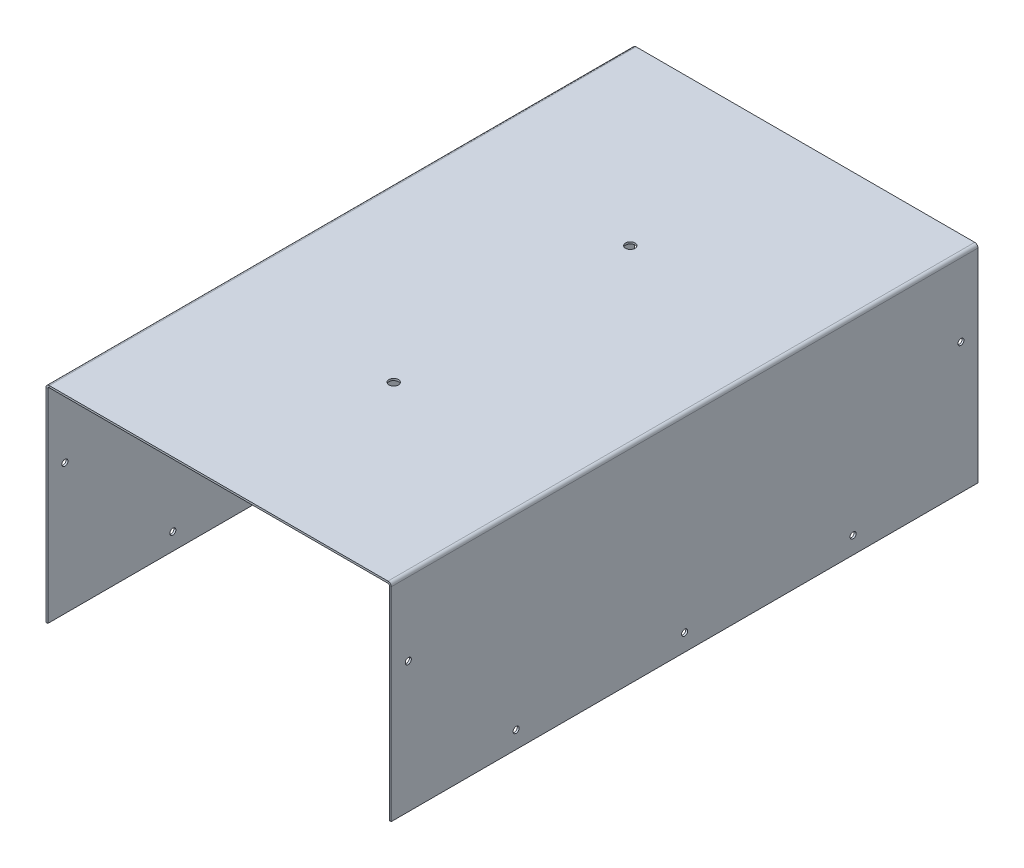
ISO-10303-21;
HEADER;
FILE_DESCRIPTION(('STEP AP214'),'2;1');
FILE_NAME('part.step','',(''),(''),'','','');
FILE_SCHEMA(('AUTOMOTIVE_DESIGN { 1 0 10303 214 1 1 1 1 }'));
ENDSEC;
DATA;
#1=APPLICATION_CONTEXT('core data for automotive mechanical design processes');
#2=APPLICATION_PROTOCOL_DEFINITION('international standard','automotive_design',2000,#1);
#3=PRODUCT_CONTEXT('',#1,'mechanical');
#4=PRODUCT('Part','Part','',(#3));
#5=PRODUCT_RELATED_PRODUCT_CATEGORY('part','',(#4));
#6=PRODUCT_DEFINITION_FORMATION('','',#4);
#7=PRODUCT_DEFINITION_CONTEXT('part definition',#1,'design');
#8=PRODUCT_DEFINITION('design','',#6,#7);
#9=PRODUCT_DEFINITION_SHAPE('','',#8);
#10=(LENGTH_UNIT() NAMED_UNIT(*) SI_UNIT(.MILLI.,.METRE.));
#11=(NAMED_UNIT(*) PLANE_ANGLE_UNIT() SI_UNIT($,.RADIAN.));
#12=(NAMED_UNIT(*) SI_UNIT($,.STERADIAN.) SOLID_ANGLE_UNIT());
#13=UNCERTAINTY_MEASURE_WITH_UNIT(LENGTH_MEASURE(1.E-05),#10,'distance_accuracy_value','');
#14=(GEOMETRIC_REPRESENTATION_CONTEXT(3) GLOBAL_UNCERTAINTY_ASSIGNED_CONTEXT((#13)) GLOBAL_UNIT_ASSIGNED_CONTEXT((#10,
#11,#12)) REPRESENTATION_CONTEXT('',''));
#15=CARTESIAN_POINT('',(0.,0.,0.));
#16=DIRECTION('',(0.,0.,1.));
#17=DIRECTION('',(1.,0.,0.));
#18=AXIS2_PLACEMENT_3D('',#15,#16,#17);
#19=CARTESIAN_POINT('',(-90.2,-1.,-155.));
#20=DIRECTION('',(0.,1.,0.));
#21=DIRECTION('',(0.,0.,1.));
#22=AXIS2_PLACEMENT_3D('',#19,#20,#21);
#23=PLANE('',#22);
#24=CARTESIAN_POINT('',(1.30236736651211E-12,-1.,62.5));
#25=DIRECTION('',(0.,1.,0.));
#26=DIRECTION('',(0.,0.,1.));
#27=AXIS2_PLACEMENT_3D('',#24,#25,#26);
#28=CIRCLE('',#27,2.5);
#29=CARTESIAN_POINT('',(1.30236736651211E-12,-1.,65.));
#30=VERTEX_POINT('',#29);
#31=EDGE_CURVE('E303',#30,#30,#28,.F.);
#32=ORIENTED_EDGE('',*,*,#31,.F.);
#33=EDGE_LOOP('',(#32));
#34=FACE_BOUND('',#33,.T.);
#35=CARTESIAN_POINT('',(0.,-1.,-62.5));
#36=DIRECTION('',(0.,1.,0.));
#37=DIRECTION('',(0.,0.,1.));
#38=AXIS2_PLACEMENT_3D('',#35,#36,#37);
#39=CIRCLE('',#38,2.5);
#40=CARTESIAN_POINT('',(0.,-1.,-60.));
#41=VERTEX_POINT('',#40);
#42=EDGE_CURVE('E309',#41,#41,#39,.F.);
#43=ORIENTED_EDGE('',*,*,#42,.F.);
#44=EDGE_LOOP('',(#43));
#45=FACE_BOUND('',#44,.T.);
#46=DIRECTION('',(0.,0.,-1.));
#47=VECTOR('',#46,1.);
#48=CARTESIAN_POINT('',(-89.4634,-1.00000000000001,-155.));
#49=LINE('',#48,#47);
#50=CARTESIAN_POINT('',(-89.4634,-1.00000000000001,-155.));
#51=VERTEX_POINT('',#50);
#52=CARTESIAN_POINT('',(-89.4634,-1.00000000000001,155.));
#53=VERTEX_POINT('',#52);
#54=EDGE_CURVE('E182',#51,#53,#49,.F.);
#55=ORIENTED_EDGE('',*,*,#54,.F.);
#56=DIRECTION('',(-1.,0.,0.));
#57=VECTOR('',#56,1.);
#58=CARTESIAN_POINT('',(90.2,-1.,-155.));
#59=LINE('',#58,#57);
#60=CARTESIAN_POINT('',(89.4634,-0.999999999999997,-155.));
#61=VERTEX_POINT('',#60);
#62=EDGE_CURVE('E11',#61,#51,#59,.T.);
#63=ORIENTED_EDGE('',*,*,#62,.F.);
#64=DIRECTION('',(0.,0.,1.));
#65=VECTOR('',#64,1.);
#66=CARTESIAN_POINT('',(89.4634,-0.999999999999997,155.));
#67=LINE('',#66,#65);
#68=CARTESIAN_POINT('',(89.4634,-0.999999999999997,155.));
#69=VERTEX_POINT('',#68);
#70=EDGE_CURVE('E230',#69,#61,#67,.F.);
#71=ORIENTED_EDGE('',*,*,#70,.F.);
#72=DIRECTION('',(1.,0.,0.));
#73=VECTOR('',#72,1.);
#74=CARTESIAN_POINT('',(90.2,-1.,155.));
#75=LINE('',#74,#73);
#76=EDGE_CURVE('E46',#53,#69,#75,.T.);
#77=ORIENTED_EDGE('',*,*,#76,.F.);
#78=EDGE_LOOP('',(#55,#63,#71,#77));
#79=FACE_BOUND('',#78,.T.);
#80=ADVANCED_FACE('F37',(#34,#45,#79),#23,.F.);
#81=CARTESIAN_POINT('',(-90.2,0.,-155.));
#82=DIRECTION('',(0.,1.,0.));
#83=DIRECTION('',(0.,0.,1.));
#84=AXIS2_PLACEMENT_3D('',#81,#82,#83);
#85=PLANE('',#84);
#86=CARTESIAN_POINT('',(1.30236736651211E-12,0.,62.5));
#87=DIRECTION('',(0.,1.,0.));
#88=DIRECTION('',(0.,0.,1.));
#89=AXIS2_PLACEMENT_3D('',#86,#87,#88);
#90=CIRCLE('',#89,2.5);
#91=CARTESIAN_POINT('',(1.30236736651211E-12,0.,65.));
#92=VERTEX_POINT('',#91);
#93=EDGE_CURVE('E300',#92,#92,#90,.T.);
#94=ORIENTED_EDGE('',*,*,#93,.F.);
#95=EDGE_LOOP('',(#94));
#96=FACE_BOUND('',#95,.T.);
#97=CARTESIAN_POINT('',(0.,0.,-62.5));
#98=DIRECTION('',(0.,1.,0.));
#99=DIRECTION('',(0.,0.,1.));
#100=AXIS2_PLACEMENT_3D('',#97,#98,#99);
#101=CIRCLE('',#100,2.5);
#102=CARTESIAN_POINT('',(0.,0.,-60.));
#103=VERTEX_POINT('',#102);
#104=EDGE_CURVE('E306',#103,#103,#101,.T.);
#105=ORIENTED_EDGE('',*,*,#104,.F.);
#106=EDGE_LOOP('',(#105));
#107=FACE_BOUND('',#106,.T.);
#108=DIRECTION('',(-1.,0.,0.));
#109=VECTOR('',#108,1.);
#110=CARTESIAN_POINT('',(90.2,0.,-155.));
#111=LINE('',#110,#109);
#112=CARTESIAN_POINT('',(89.4634,0.,-155.));
#113=VERTEX_POINT('',#112);
#114=CARTESIAN_POINT('',(-89.4634,0.,-155.));
#115=VERTEX_POINT('',#114);
#116=EDGE_CURVE('E240',#113,#115,#111,.T.);
#117=ORIENTED_EDGE('',*,*,#116,.T.);
#118=DIRECTION('',(0.,0.,-1.));
#119=VECTOR('',#118,1.);
#120=CARTESIAN_POINT('',(-89.4634,0.,-155.));
#121=LINE('',#120,#119);
#122=CARTESIAN_POINT('',(-89.4634,0.,155.));
#123=VERTEX_POINT('',#122);
#124=EDGE_CURVE('E132',#115,#123,#121,.F.);
#125=ORIENTED_EDGE('',*,*,#124,.T.);
#126=DIRECTION('',(1.,0.,0.));
#127=VECTOR('',#126,1.);
#128=CARTESIAN_POINT('',(90.2,0.,155.));
#129=LINE('',#128,#127);
#130=CARTESIAN_POINT('',(89.4634,0.,155.));
#131=VERTEX_POINT('',#130);
#132=EDGE_CURVE('E236',#123,#131,#129,.T.);
#133=ORIENTED_EDGE('',*,*,#132,.T.);
#134=DIRECTION('',(0.,0.,1.));
#135=VECTOR('',#134,1.);
#136=CARTESIAN_POINT('',(89.4634,0.,155.));
#137=LINE('',#136,#135);
#138=EDGE_CURVE('E219',#131,#113,#137,.F.);
#139=ORIENTED_EDGE('',*,*,#138,.T.);
#140=EDGE_LOOP('',(#117,#125,#133,#139));
#141=FACE_BOUND('',#140,.T.);
#142=ADVANCED_FACE('F347',(#96,#107,#141),#85,.T.);
#143=CARTESIAN_POINT('',(90.2,-1.,-155.));
#144=DIRECTION('',(0.,0.,-1.));
#145=DIRECTION('',(-1.,0.,0.));
#146=AXIS2_PLACEMENT_3D('',#143,#144,#145);
#147=PLANE('',#146);
#148=ORIENTED_EDGE('',*,*,#62,.T.);
#149=DIRECTION('',(0.,1.,0.));
#150=VECTOR('',#149,1.);
#151=CARTESIAN_POINT('',(-89.4634,-1.00000000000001,-155.));
#152=LINE('',#151,#150);
#153=EDGE_CURVE('E178',#51,#115,#152,.T.);
#154=ORIENTED_EDGE('',*,*,#153,.T.);
#155=ORIENTED_EDGE('',*,*,#116,.F.);
#156=DIRECTION('',(0.,1.,0.));
#157=VECTOR('',#156,1.);
#158=CARTESIAN_POINT('',(89.4634,-0.999999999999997,-155.));
#159=LINE('',#158,#157);
#160=EDGE_CURVE('E234',#61,#113,#159,.T.);
#161=ORIENTED_EDGE('',*,*,#160,.F.);
#162=EDGE_LOOP('',(#148,#154,#155,#161));
#163=FACE_BOUND('',#162,.T.);
#164=ADVANCED_FACE('F353',(#163),#147,.T.);
#165=CARTESIAN_POINT('',(90.2,-1.,155.));
#166=DIRECTION('',(0.,0.,1.));
#167=DIRECTION('',(1.,0.,0.));
#168=AXIS2_PLACEMENT_3D('',#165,#166,#167);
#169=PLANE('',#168);
#170=DIRECTION('',(0.,1.,0.));
#171=VECTOR('',#170,1.);
#172=CARTESIAN_POINT('',(-89.4634,-1.00000000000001,155.));
#173=LINE('',#172,#171);
#174=EDGE_CURVE('E185',#53,#123,#173,.T.);
#175=ORIENTED_EDGE('',*,*,#174,.F.);
#176=ORIENTED_EDGE('',*,*,#76,.T.);
#177=DIRECTION('',(0.,1.,0.));
#178=VECTOR('',#177,1.);
#179=CARTESIAN_POINT('',(89.4634,-0.999999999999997,155.));
#180=LINE('',#179,#178);
#181=EDGE_CURVE('E224',#69,#131,#180,.T.);
#182=ORIENTED_EDGE('',*,*,#181,.T.);
#183=ORIENTED_EDGE('',*,*,#132,.F.);
#184=EDGE_LOOP('',(#175,#176,#182,#183));
#185=FACE_BOUND('',#184,.T.);
#186=ADVANCED_FACE('F39',(#185),#169,.T.);
#187=CARTESIAN_POINT('',(89.4634,-1.7366,-155.));
#188=DIRECTION('',(0.,0.,-1.));
#189=DIRECTION('',(-1.,0.,0.));
#190=AXIS2_PLACEMENT_3D('',#187,#188,#189);
#191=PLANE('',#190);
#192=DIRECTION('',(1.,0.,0.));
#193=VECTOR('',#192,1.);
#194=CARTESIAN_POINT('',(90.2,-1.7366,-155.));
#195=LINE('',#194,#193);
#196=CARTESIAN_POINT('',(90.2,-1.7366,-155.));
#197=VERTEX_POINT('',#196);
#198=CARTESIAN_POINT('',(91.2,-1.73659999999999,-155.));
#199=VERTEX_POINT('',#198);
#200=EDGE_CURVE('E187',#197,#199,#195,.T.);
#201=ORIENTED_EDGE('',*,*,#200,.F.);
#202=CARTESIAN_POINT('',(89.4634,-1.7366,-155.));
#203=DIRECTION('',(0.,0.,1.));
#204=DIRECTION('',(1.,0.,0.));
#205=AXIS2_PLACEMENT_3D('',#202,#203,#204);
#206=CIRCLE('',#205,0.736600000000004);
#207=EDGE_CURVE('E227',#61,#197,#206,.F.);
#208=ORIENTED_EDGE('',*,*,#207,.F.);
#209=ORIENTED_EDGE('',*,*,#160,.T.);
#210=CARTESIAN_POINT('',(89.4634,-1.7366,-155.));
#211=DIRECTION('',(0.,0.,1.));
#212=DIRECTION('',(1.,0.,0.));
#213=AXIS2_PLACEMENT_3D('',#210,#211,#212);
#214=CIRCLE('',#213,1.7366);
#215=EDGE_CURVE('E54',#113,#199,#214,.F.);
#216=ORIENTED_EDGE('',*,*,#215,.T.);
#217=EDGE_LOOP('',(#201,#208,#209,#216));
#218=FACE_BOUND('',#217,.T.);
#219=ADVANCED_FACE('F366',(#218),#191,.T.);
#220=CARTESIAN_POINT('',(89.4634,-1.7366,155.));
#221=DIRECTION('',(0.,0.,-1.));
#222=DIRECTION('',(-1.,0.,0.));
#223=AXIS2_PLACEMENT_3D('',#220,#221,#222);
#224=PLANE('',#223);
#225=CARTESIAN_POINT('',(89.4634,-1.7366,155.));
#226=DIRECTION('',(0.,0.,1.));
#227=DIRECTION('',(1.,0.,0.));
#228=AXIS2_PLACEMENT_3D('',#225,#226,#227);
#229=CIRCLE('',#228,0.736600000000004);
#230=CARTESIAN_POINT('',(90.2,-1.7366,155.));
#231=VERTEX_POINT('',#230);
#232=EDGE_CURVE('E218',#231,#69,#229,.T.);
#233=ORIENTED_EDGE('',*,*,#232,.F.);
#234=DIRECTION('',(1.,0.,0.));
#235=VECTOR('',#234,1.);
#236=CARTESIAN_POINT('',(90.2,-1.73659999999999,155.));
#237=LINE('',#236,#235);
#238=CARTESIAN_POINT('',(91.2,-1.73659999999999,155.));
#239=VERTEX_POINT('',#238);
#240=EDGE_CURVE('E191',#231,#239,#237,.T.);
#241=ORIENTED_EDGE('',*,*,#240,.T.);
#242=CARTESIAN_POINT('',(89.4634,-1.7366,155.));
#243=DIRECTION('',(0.,0.,1.));
#244=DIRECTION('',(1.,0.,0.));
#245=AXIS2_PLACEMENT_3D('',#242,#243,#244);
#246=CIRCLE('',#245,1.7366);
#247=EDGE_CURVE('E222',#239,#131,#246,.T.);
#248=ORIENTED_EDGE('',*,*,#247,.T.);
#249=ORIENTED_EDGE('',*,*,#181,.F.);
#250=EDGE_LOOP('',(#233,#241,#248,#249));
#251=FACE_BOUND('',#250,.T.);
#252=ADVANCED_FACE('F359',(#251),#224,.F.);
#253=CARTESIAN_POINT('',(89.4634,-1.7366,155.));
#254=DIRECTION('',(0.,0.,1.));
#255=DIRECTION('',(1.,0.,0.));
#256=AXIS2_PLACEMENT_3D('',#253,#254,#255);
#257=CYLINDRICAL_SURFACE('',#256,1.7366);
#258=ORIENTED_EDGE('',*,*,#138,.F.);
#259=ORIENTED_EDGE('',*,*,#247,.F.);
#260=DIRECTION('',(0.,0.,-1.));
#261=VECTOR('',#260,1.);
#262=CARTESIAN_POINT('',(91.2,-1.7366,-155.));
#263=LINE('',#262,#261);
#264=EDGE_CURVE('E194',#239,#199,#263,.T.);
#265=ORIENTED_EDGE('',*,*,#264,.T.);
#266=ORIENTED_EDGE('',*,*,#215,.F.);
#267=EDGE_LOOP('',(#258,#259,#265,#266));
#268=FACE_BOUND('',#267,.T.);
#269=ADVANCED_FACE('F376',(#268),#257,.T.);
#270=CARTESIAN_POINT('',(89.4634,-1.7366,155.));
#271=DIRECTION('',(0.,0.,1.));
#272=DIRECTION('',(1.,0.,0.));
#273=AXIS2_PLACEMENT_3D('',#270,#271,#272);
#274=CYLINDRICAL_SURFACE('',#273,0.736600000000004);
#275=ORIENTED_EDGE('',*,*,#70,.T.);
#276=ORIENTED_EDGE('',*,*,#207,.T.);
#277=DIRECTION('',(0.,0.,1.));
#278=VECTOR('',#277,1.);
#279=CARTESIAN_POINT('',(90.2,-1.7366,-155.));
#280=LINE('',#279,#278);
#281=EDGE_CURVE('E189',#197,#231,#280,.T.);
#282=ORIENTED_EDGE('',*,*,#281,.T.);
#283=ORIENTED_EDGE('',*,*,#232,.T.);
#284=EDGE_LOOP('',(#275,#276,#282,#283));
#285=FACE_BOUND('',#284,.T.);
#286=ADVANCED_FACE('F401',(#285),#274,.F.);
#287=CARTESIAN_POINT('',(91.2000000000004,-109.2,155.));
#288=DIRECTION('',(0.,0.,-1.));
#289=DIRECTION('',(-1.,0.,0.));
#290=AXIS2_PLACEMENT_3D('',#287,#288,#289);
#291=PLANE('',#290);
#292=ORIENTED_EDGE('',*,*,#240,.F.);
#293=DIRECTION('',(0.,-1.,0.));
#294=VECTOR('',#293,1.);
#295=CARTESIAN_POINT('',(90.2000000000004,-109.2,155.));
#296=LINE('',#295,#294);
#297=CARTESIAN_POINT('',(90.2000000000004,-109.2,155.));
#298=VERTEX_POINT('',#297);
#299=EDGE_CURVE('E198',#231,#298,#296,.T.);
#300=ORIENTED_EDGE('',*,*,#299,.T.);
#301=DIRECTION('',(-1.,0.,0.));
#302=VECTOR('',#301,1.);
#303=CARTESIAN_POINT('',(91.2000000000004,-109.2,155.));
#304=LINE('',#303,#302);
#305=CARTESIAN_POINT('',(91.2000000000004,-109.2,155.));
#306=VERTEX_POINT('',#305);
#307=EDGE_CURVE('E215',#306,#298,#304,.T.);
#308=ORIENTED_EDGE('',*,*,#307,.F.);
#309=DIRECTION('',(0.,-1.,0.));
#310=VECTOR('',#309,1.);
#311=CARTESIAN_POINT('',(91.2000000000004,-109.2,155.));
#312=LINE('',#311,#310);
#313=EDGE_CURVE('E199',#239,#306,#312,.T.);
#314=ORIENTED_EDGE('',*,*,#313,.F.);
#315=EDGE_LOOP('',(#292,#300,#308,#314));
#316=FACE_BOUND('',#315,.T.);
#317=ADVANCED_FACE('F388',(#316),#291,.F.);
#318=CARTESIAN_POINT('',(91.2,-0.999999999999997,-155.));
#319=DIRECTION('',(0.,0.,1.));
#320=DIRECTION('',(1.,0.,0.));
#321=AXIS2_PLACEMENT_3D('',#318,#319,#320);
#322=PLANE('',#321);
#323=ORIENTED_EDGE('',*,*,#200,.T.);
#324=DIRECTION('',(0.,1.,0.));
#325=VECTOR('',#324,1.);
#326=CARTESIAN_POINT('',(91.2,-0.999999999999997,-155.));
#327=LINE('',#326,#325);
#328=CARTESIAN_POINT('',(91.2000000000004,-109.2,-155.));
#329=VERTEX_POINT('',#328);
#330=EDGE_CURVE('E204',#329,#199,#327,.T.);
#331=ORIENTED_EDGE('',*,*,#330,.F.);
#332=DIRECTION('',(-1.,0.,0.));
#333=VECTOR('',#332,1.);
#334=CARTESIAN_POINT('',(91.2000000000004,-109.2,-155.));
#335=LINE('',#334,#333);
#336=CARTESIAN_POINT('',(90.2000000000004,-109.2,-155.));
#337=VERTEX_POINT('',#336);
#338=EDGE_CURVE('E207',#329,#337,#335,.T.);
#339=ORIENTED_EDGE('',*,*,#338,.T.);
#340=DIRECTION('',(0.,1.,0.));
#341=VECTOR('',#340,1.);
#342=CARTESIAN_POINT('',(90.2,-1.,-155.));
#343=LINE('',#342,#341);
#344=EDGE_CURVE('E202',#337,#197,#343,.T.);
#345=ORIENTED_EDGE('',*,*,#344,.T.);
#346=EDGE_LOOP('',(#323,#331,#339,#345));
#347=FACE_BOUND('',#346,.T.);
#348=ADVANCED_FACE('F396',(#347),#322,.F.);
#349=CARTESIAN_POINT('',(91.2,-0.999999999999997,-155.));
#350=DIRECTION('',(-1.,0.,0.));
#351=DIRECTION('',(0.,-1.,0.));
#352=AXIS2_PLACEMENT_3D('',#349,#350,#351);
#353=PLANE('',#352);
#354=CARTESIAN_POINT('',(91.2000000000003,-100.2,1.13686837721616E-13));
#355=DIRECTION('',(1.,0.,0.));
#356=DIRECTION('',(0.,1.,0.));
#357=AXIS2_PLACEMENT_3D('',#354,#355,#356);
#358=CIRCLE('',#357,1.6);
#359=CARTESIAN_POINT('',(91.2000000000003,-98.5999999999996,1.13686837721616E-13));
#360=VERTEX_POINT('',#359);
#361=EDGE_CURVE('E749',#360,#360,#358,.T.);
#362=ORIENTED_EDGE('',*,*,#361,.F.);
#363=EDGE_LOOP('',(#362));
#364=FACE_BOUND('',#363,.T.);
#365=CARTESIAN_POINT('',(91.2000000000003,-100.2,-88.9999999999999));
#366=DIRECTION('',(1.,0.,0.));
#367=DIRECTION('',(0.,1.,0.));
#368=AXIS2_PLACEMENT_3D('',#365,#366,#367);
#369=CIRCLE('',#368,1.6);
#370=CARTESIAN_POINT('',(91.2000000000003,-98.5999999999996,-88.9999999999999));
#371=VERTEX_POINT('',#370);
#372=EDGE_CURVE('E270',#371,#371,#369,.T.);
#373=ORIENTED_EDGE('',*,*,#372,.F.);
#374=EDGE_LOOP('',(#373));
#375=FACE_BOUND('',#374,.T.);
#376=CARTESIAN_POINT('',(91.2000000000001,-40.1999999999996,-146.));
#377=DIRECTION('',(1.,0.,0.));
#378=DIRECTION('',(0.,1.,0.));
#379=AXIS2_PLACEMENT_3D('',#376,#377,#378);
#380=CIRCLE('',#379,1.59999999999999);
#381=CARTESIAN_POINT('',(91.2000000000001,-38.5999999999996,-146.));
#382=VERTEX_POINT('',#381);
#383=EDGE_CURVE('E267',#382,#382,#380,.T.);
#384=ORIENTED_EDGE('',*,*,#383,.F.);
#385=EDGE_LOOP('',(#384));
#386=FACE_BOUND('',#385,.T.);
#387=CARTESIAN_POINT('',(91.2000000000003,-100.2,89.0000000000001));
#388=DIRECTION('',(1.,0.,0.));
#389=DIRECTION('',(0.,1.,0.));
#390=AXIS2_PLACEMENT_3D('',#387,#388,#389);
#391=CIRCLE('',#390,1.6);
#392=CARTESIAN_POINT('',(91.2000000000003,-98.5999999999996,89.0000000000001));
#393=VERTEX_POINT('',#392);
#394=EDGE_CURVE('E286',#393,#393,#391,.T.);
#395=ORIENTED_EDGE('',*,*,#394,.F.);
#396=EDGE_LOOP('',(#395));
#397=FACE_BOUND('',#396,.T.);
#398=CARTESIAN_POINT('',(91.2000000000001,-40.1999999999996,146.));
#399=DIRECTION('',(1.,0.,0.));
#400=DIRECTION('',(0.,1.,0.));
#401=AXIS2_PLACEMENT_3D('',#398,#399,#400);
#402=CIRCLE('',#401,1.59999999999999);
#403=CARTESIAN_POINT('',(91.2000000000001,-38.5999999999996,146.));
#404=VERTEX_POINT('',#403);
#405=EDGE_CURVE('E293',#404,#404,#402,.T.);
#406=ORIENTED_EDGE('',*,*,#405,.F.);
#407=EDGE_LOOP('',(#406));
#408=FACE_BOUND('',#407,.T.);
#409=ORIENTED_EDGE('',*,*,#264,.F.);
#410=ORIENTED_EDGE('',*,*,#313,.T.);
#411=DIRECTION('',(0.,0.,-1.));
#412=VECTOR('',#411,1.);
#413=CARTESIAN_POINT('',(91.2000000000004,-109.2,-155.));
#414=LINE('',#413,#412);
#415=EDGE_CURVE('E201',#306,#329,#414,.T.);
#416=ORIENTED_EDGE('',*,*,#415,.T.);
#417=ORIENTED_EDGE('',*,*,#330,.T.);
#418=EDGE_LOOP('',(#409,#410,#416,#417));
#419=FACE_BOUND('',#418,.T.);
#420=ADVANCED_FACE('F385',(#364,#375,#386,#397,#408,#419),#353,.F.);
#421=CARTESIAN_POINT('',(90.2,-1.,-155.));
#422=DIRECTION('',(-1.,0.,0.));
#423=DIRECTION('',(0.,-1.,0.));
#424=AXIS2_PLACEMENT_3D('',#421,#422,#423);
#425=PLANE('',#424);
#426=CARTESIAN_POINT('',(90.2000000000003,-100.2,1.13686837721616E-13));
#427=DIRECTION('',(-1.,0.,0.));
#428=DIRECTION('',(0.,-1.,0.));
#429=AXIS2_PLACEMENT_3D('',#426,#427,#428);
#430=CIRCLE('',#429,1.6);
#431=CARTESIAN_POINT('',(90.2000000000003,-101.8,1.13686837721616E-13));
#432=VERTEX_POINT('',#431);
#433=EDGE_CURVE('E275',#432,#432,#430,.T.);
#434=ORIENTED_EDGE('',*,*,#433,.F.);
#435=EDGE_LOOP('',(#434));
#436=FACE_BOUND('',#435,.T.);
#437=CARTESIAN_POINT('',(90.2000000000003,-100.2,-88.9999999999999));
#438=DIRECTION('',(-1.,0.,0.));
#439=DIRECTION('',(0.,-1.,0.));
#440=AXIS2_PLACEMENT_3D('',#437,#438,#439);
#441=CIRCLE('',#440,1.6);
#442=CARTESIAN_POINT('',(90.2000000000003,-101.8,-88.9999999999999));
#443=VERTEX_POINT('',#442);
#444=EDGE_CURVE('E262',#443,#443,#441,.T.);
#445=ORIENTED_EDGE('',*,*,#444,.F.);
#446=EDGE_LOOP('',(#445));
#447=FACE_BOUND('',#446,.T.);
#448=CARTESIAN_POINT('',(90.2000000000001,-40.1999999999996,-146.));
#449=DIRECTION('',(-1.,0.,0.));
#450=DIRECTION('',(0.,-1.,0.));
#451=AXIS2_PLACEMENT_3D('',#448,#449,#450);
#452=CIRCLE('',#451,1.59999999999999);
#453=CARTESIAN_POINT('',(90.2000000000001,-41.7999999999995,-146.));
#454=VERTEX_POINT('',#453);
#455=EDGE_CURVE('E258',#454,#454,#452,.T.);
#456=ORIENTED_EDGE('',*,*,#455,.F.);
#457=EDGE_LOOP('',(#456));
#458=FACE_BOUND('',#457,.T.);
#459=CARTESIAN_POINT('',(90.2000000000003,-100.2,89.0000000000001));
#460=DIRECTION('',(-1.,0.,0.));
#461=DIRECTION('',(0.,-1.,0.));
#462=AXIS2_PLACEMENT_3D('',#459,#460,#461);
#463=CIRCLE('',#462,1.6);
#464=CARTESIAN_POINT('',(90.2000000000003,-101.8,89.0000000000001));
#465=VERTEX_POINT('',#464);
#466=EDGE_CURVE('E254',#465,#465,#463,.T.);
#467=ORIENTED_EDGE('',*,*,#466,.F.);
#468=EDGE_LOOP('',(#467));
#469=FACE_BOUND('',#468,.T.);
#470=CARTESIAN_POINT('',(90.2000000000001,-40.1999999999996,146.));
#471=DIRECTION('',(-1.,0.,0.));
#472=DIRECTION('',(0.,-1.,0.));
#473=AXIS2_PLACEMENT_3D('',#470,#471,#472);
#474=CIRCLE('',#473,1.59999999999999);
#475=CARTESIAN_POINT('',(90.2000000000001,-41.7999999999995,146.));
#476=VERTEX_POINT('',#475);
#477=EDGE_CURVE('E249',#476,#476,#474,.T.);
#478=ORIENTED_EDGE('',*,*,#477,.F.);
#479=EDGE_LOOP('',(#478));
#480=FACE_BOUND('',#479,.T.);
#481=ORIENTED_EDGE('',*,*,#299,.F.);
#482=ORIENTED_EDGE('',*,*,#281,.F.);
#483=ORIENTED_EDGE('',*,*,#344,.F.);
#484=DIRECTION('',(0.,0.,-1.));
#485=VECTOR('',#484,1.);
#486=CARTESIAN_POINT('',(90.2000000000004,-109.2,-155.));
#487=LINE('',#486,#485);
#488=EDGE_CURVE('E209',#298,#337,#487,.T.);
#489=ORIENTED_EDGE('',*,*,#488,.F.);
#490=EDGE_LOOP('',(#481,#482,#483,#489));
#491=FACE_BOUND('',#490,.T.);
#492=ADVANCED_FACE('F403',(#436,#447,#458,#469,#480,#491),#425,.T.);
#493=CARTESIAN_POINT('',(91.2000000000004,-109.2,-155.));
#494=DIRECTION('',(0.,1.,0.));
#495=DIRECTION('',(-1.,0.,0.));
#496=AXIS2_PLACEMENT_3D('',#493,#494,#495);
#497=PLANE('',#496);
#498=ORIENTED_EDGE('',*,*,#488,.T.);
#499=ORIENTED_EDGE('',*,*,#338,.F.);
#500=ORIENTED_EDGE('',*,*,#415,.F.);
#501=ORIENTED_EDGE('',*,*,#307,.T.);
#502=EDGE_LOOP('',(#498,#499,#500,#501));
#503=FACE_BOUND('',#502,.T.);
#504=ADVANCED_FACE('F393',(#503),#497,.F.);
#505=CARTESIAN_POINT('',(-89.4634,-1.73660000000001,155.));
#506=DIRECTION('',(0.,0.,1.));
#507=DIRECTION('',(1.,0.,0.));
#508=AXIS2_PLACEMENT_3D('',#505,#506,#507);
#509=PLANE('',#508);
#510=DIRECTION('',(-1.,0.,0.));
#511=VECTOR('',#510,1.);
#512=CARTESIAN_POINT('',(-90.2,-1.7366,155.));
#513=LINE('',#512,#511);
#514=CARTESIAN_POINT('',(-90.2,-1.73660000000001,155.));
#515=VERTEX_POINT('',#514);
#516=CARTESIAN_POINT('',(-91.2,-1.73660000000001,155.));
#517=VERTEX_POINT('',#516);
#518=EDGE_CURVE('E312',#515,#517,#513,.T.);
#519=ORIENTED_EDGE('',*,*,#518,.F.);
#520=CARTESIAN_POINT('',(-89.4634,-1.73660000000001,155.));
#521=DIRECTION('',(0.,0.,-1.));
#522=DIRECTION('',(-1.,0.,0.));
#523=AXIS2_PLACEMENT_3D('',#520,#521,#522);
#524=CIRCLE('',#523,0.736600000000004);
#525=EDGE_CURVE('E135',#53,#515,#524,.F.);
#526=ORIENTED_EDGE('',*,*,#525,.F.);
#527=ORIENTED_EDGE('',*,*,#174,.T.);
#528=CARTESIAN_POINT('',(-89.4634,-1.73660000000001,155.));
#529=DIRECTION('',(0.,0.,-1.));
#530=DIRECTION('',(-1.,0.,0.));
#531=AXIS2_PLACEMENT_3D('',#528,#529,#530);
#532=CIRCLE('',#531,1.7366);
#533=EDGE_CURVE('E62',#123,#517,#532,.F.);
#534=ORIENTED_EDGE('',*,*,#533,.T.);
#535=EDGE_LOOP('',(#519,#526,#527,#534));
#536=FACE_BOUND('',#535,.T.);
#537=ADVANCED_FACE('F319',(#536),#509,.T.);
#538=CARTESIAN_POINT('',(-89.4634,-1.73660000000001,-155.));
#539=DIRECTION('',(0.,0.,1.));
#540=DIRECTION('',(1.,0.,0.));
#541=AXIS2_PLACEMENT_3D('',#538,#539,#540);
#542=PLANE('',#541);
#543=CARTESIAN_POINT('',(-89.4634,-1.73660000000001,-155.));
#544=DIRECTION('',(0.,0.,-1.));
#545=DIRECTION('',(-1.,0.,0.));
#546=AXIS2_PLACEMENT_3D('',#543,#544,#545);
#547=CIRCLE('',#546,0.736600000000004);
#548=CARTESIAN_POINT('',(-90.2,-1.73660000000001,-155.));
#549=VERTEX_POINT('',#548);
#550=EDGE_CURVE('E142',#549,#51,#547,.T.);
#551=ORIENTED_EDGE('',*,*,#550,.F.);
#552=DIRECTION('',(-1.,0.,0.));
#553=VECTOR('',#552,1.);
#554=CARTESIAN_POINT('',(-90.2,-1.73660000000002,-155.));
#555=LINE('',#554,#553);
#556=CARTESIAN_POINT('',(-91.2,-1.73660000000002,-155.));
#557=VERTEX_POINT('',#556);
#558=EDGE_CURVE('E139',#549,#557,#555,.T.);
#559=ORIENTED_EDGE('',*,*,#558,.T.);
#560=CARTESIAN_POINT('',(-89.4634,-1.73660000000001,-155.));
#561=DIRECTION('',(0.,0.,-1.));
#562=DIRECTION('',(-1.,0.,0.));
#563=AXIS2_PLACEMENT_3D('',#560,#561,#562);
#564=CIRCLE('',#563,1.7366);
#565=EDGE_CURVE('E126',#557,#115,#564,.T.);
#566=ORIENTED_EDGE('',*,*,#565,.T.);
#567=ORIENTED_EDGE('',*,*,#153,.F.);
#568=EDGE_LOOP('',(#551,#559,#566,#567));
#569=FACE_BOUND('',#568,.T.);
#570=ADVANCED_FACE('F140',(#569),#542,.F.);
#571=CARTESIAN_POINT('',(-89.4634,-1.73660000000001,-155.));
#572=DIRECTION('',(0.,0.,-1.));
#573=DIRECTION('',(-1.,0.,0.));
#574=AXIS2_PLACEMENT_3D('',#571,#572,#573);
#575=CYLINDRICAL_SURFACE('',#574,1.7366);
#576=ORIENTED_EDGE('',*,*,#124,.F.);
#577=ORIENTED_EDGE('',*,*,#565,.F.);
#578=DIRECTION('',(0.,0.,1.));
#579=VECTOR('',#578,1.);
#580=CARTESIAN_POINT('',(-91.2,-1.73660000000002,-155.));
#581=LINE('',#580,#579);
#582=EDGE_CURVE('E130',#557,#517,#581,.T.);
#583=ORIENTED_EDGE('',*,*,#582,.T.);
#584=ORIENTED_EDGE('',*,*,#533,.F.);
#585=EDGE_LOOP('',(#576,#577,#583,#584));
#586=FACE_BOUND('',#585,.T.);
#587=ADVANCED_FACE('F128',(#586),#575,.T.);
#588=CARTESIAN_POINT('',(-89.4634,-1.73660000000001,-155.));
#589=DIRECTION('',(0.,0.,-1.));
#590=DIRECTION('',(-1.,0.,0.));
#591=AXIS2_PLACEMENT_3D('',#588,#589,#590);
#592=CYLINDRICAL_SURFACE('',#591,0.736600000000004);
#593=ORIENTED_EDGE('',*,*,#54,.T.);
#594=ORIENTED_EDGE('',*,*,#525,.T.);
#595=DIRECTION('',(0.,0.,-1.));
#596=VECTOR('',#595,1.);
#597=CARTESIAN_POINT('',(-90.2,-1.7366,155.));
#598=LINE('',#597,#596);
#599=EDGE_CURVE('E146',#515,#549,#598,.T.);
#600=ORIENTED_EDGE('',*,*,#599,.T.);
#601=ORIENTED_EDGE('',*,*,#550,.T.);
#602=EDGE_LOOP('',(#593,#594,#600,#601));
#603=FACE_BOUND('',#602,.T.);
#604=ADVANCED_FACE('F323',(#603),#592,.F.);
#605=CARTESIAN_POINT('',(-91.2000000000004,-109.2,-155.));
#606=DIRECTION('',(0.,0.,1.));
#607=DIRECTION('',(1.,0.,0.));
#608=AXIS2_PLACEMENT_3D('',#605,#606,#607);
#609=PLANE('',#608);
#610=ORIENTED_EDGE('',*,*,#558,.F.);
#611=DIRECTION('',(0.,-1.,0.));
#612=VECTOR('',#611,1.);
#613=CARTESIAN_POINT('',(-90.2000000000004,-109.2,-155.));
#614=LINE('',#613,#612);
#615=CARTESIAN_POINT('',(-90.2000000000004,-109.2,-155.));
#616=VERTEX_POINT('',#615);
#617=EDGE_CURVE('E155',#549,#616,#614,.T.);
#618=ORIENTED_EDGE('',*,*,#617,.T.);
#619=DIRECTION('',(1.,0.,0.));
#620=VECTOR('',#619,1.);
#621=CARTESIAN_POINT('',(-91.2000000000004,-109.2,-155.));
#622=LINE('',#621,#620);
#623=CARTESIAN_POINT('',(-91.2000000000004,-109.2,-155.));
#624=VERTEX_POINT('',#623);
#625=EDGE_CURVE('E160',#624,#616,#622,.T.);
#626=ORIENTED_EDGE('',*,*,#625,.F.);
#627=DIRECTION('',(0.,-1.,0.));
#628=VECTOR('',#627,1.);
#629=CARTESIAN_POINT('',(-91.2000000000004,-109.2,-155.));
#630=LINE('',#629,#628);
#631=EDGE_CURVE('E151',#557,#624,#630,.T.);
#632=ORIENTED_EDGE('',*,*,#631,.F.);
#633=EDGE_LOOP('',(#610,#618,#626,#632));
#634=FACE_BOUND('',#633,.T.);
#635=ADVANCED_FACE('F158',(#634),#609,.F.);
#636=CARTESIAN_POINT('',(-91.2,-0.999999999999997,155.));
#637=DIRECTION('',(0.,0.,-1.));
#638=DIRECTION('',(-1.,0.,0.));
#639=AXIS2_PLACEMENT_3D('',#636,#637,#638);
#640=PLANE('',#639);
#641=ORIENTED_EDGE('',*,*,#518,.T.);
#642=DIRECTION('',(0.,1.,0.));
#643=VECTOR('',#642,1.);
#644=CARTESIAN_POINT('',(-91.2,-0.999999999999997,155.));
#645=LINE('',#644,#643);
#646=CARTESIAN_POINT('',(-91.2000000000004,-109.2,155.));
#647=VERTEX_POINT('',#646);
#648=EDGE_CURVE('E154',#647,#517,#645,.T.);
#649=ORIENTED_EDGE('',*,*,#648,.F.);
#650=DIRECTION('',(1.,0.,0.));
#651=VECTOR('',#650,1.);
#652=CARTESIAN_POINT('',(-91.2000000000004,-109.2,155.));
#653=LINE('',#652,#651);
#654=CARTESIAN_POINT('',(-90.2000000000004,-109.2,155.));
#655=VERTEX_POINT('',#654);
#656=EDGE_CURVE('E171',#647,#655,#653,.T.);
#657=ORIENTED_EDGE('',*,*,#656,.T.);
#658=DIRECTION('',(0.,1.,0.));
#659=VECTOR('',#658,1.);
#660=CARTESIAN_POINT('',(-90.2,-1.,155.));
#661=LINE('',#660,#659);
#662=EDGE_CURVE('E162',#655,#515,#661,.T.);
#663=ORIENTED_EDGE('',*,*,#662,.T.);
#664=EDGE_LOOP('',(#641,#649,#657,#663));
#665=FACE_BOUND('',#664,.T.);
#666=ADVANCED_FACE('F315',(#665),#640,.F.);
#667=CARTESIAN_POINT('',(-91.2,-0.999999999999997,-155.));
#668=DIRECTION('',(1.,0.,0.));
#669=DIRECTION('',(0.,1.,0.));
#670=AXIS2_PLACEMENT_3D('',#667,#668,#669);
#671=PLANE('',#670);
#672=CARTESIAN_POINT('',(-91.2000000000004,-100.2,1.13686837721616E-13));
#673=DIRECTION('',(1.,0.,0.));
#674=DIRECTION('',(0.,1.,0.));
#675=AXIS2_PLACEMENT_3D('',#672,#673,#674);
#676=CIRCLE('',#675,1.6);
#677=CARTESIAN_POINT('',(-91.2000000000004,-98.6000000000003,1.13686837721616E-13));
#678=VERTEX_POINT('',#677);
#679=EDGE_CURVE('E750',#678,#678,#676,.T.);
#680=ORIENTED_EDGE('',*,*,#679,.T.);
#681=EDGE_LOOP('',(#680));
#682=FACE_BOUND('',#681,.T.);
#683=CARTESIAN_POINT('',(-91.2000000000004,-100.2,-88.9999999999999));
#684=DIRECTION('',(1.,0.,0.));
#685=DIRECTION('',(0.,1.,0.));
#686=AXIS2_PLACEMENT_3D('',#683,#684,#685);
#687=CIRCLE('',#686,1.6);
#688=CARTESIAN_POINT('',(-91.2000000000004,-98.6000000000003,-88.9999999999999));
#689=VERTEX_POINT('',#688);
#690=EDGE_CURVE('E263',#689,#689,#687,.T.);
#691=ORIENTED_EDGE('',*,*,#690,.T.);
#692=EDGE_LOOP('',(#691));
#693=FACE_BOUND('',#692,.T.);
#694=CARTESIAN_POINT('',(-91.2000000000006,-40.2000000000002,-146.));
#695=DIRECTION('',(1.,0.,0.));
#696=DIRECTION('',(0.,1.,0.));
#697=AXIS2_PLACEMENT_3D('',#694,#695,#696);
#698=CIRCLE('',#697,1.59999999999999);
#699=CARTESIAN_POINT('',(-91.2000000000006,-38.6000000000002,-146.));
#700=VERTEX_POINT('',#699);
#701=EDGE_CURVE('E259',#700,#700,#698,.T.);
#702=ORIENTED_EDGE('',*,*,#701,.T.);
#703=EDGE_LOOP('',(#702));
#704=FACE_BOUND('',#703,.T.);
#705=CARTESIAN_POINT('',(-91.2000000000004,-100.2,89.0000000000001));
#706=DIRECTION('',(1.,0.,0.));
#707=DIRECTION('',(0.,1.,0.));
#708=AXIS2_PLACEMENT_3D('',#705,#706,#707);
#709=CIRCLE('',#708,1.6);
#710=CARTESIAN_POINT('',(-91.2000000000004,-98.6000000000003,89.0000000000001));
#711=VERTEX_POINT('',#710);
#712=EDGE_CURVE('E255',#711,#711,#709,.T.);
#713=ORIENTED_EDGE('',*,*,#712,.T.);
#714=EDGE_LOOP('',(#713));
#715=FACE_BOUND('',#714,.T.);
#716=CARTESIAN_POINT('',(-91.2000000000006,-40.2000000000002,146.));
#717=DIRECTION('',(1.,0.,0.));
#718=DIRECTION('',(0.,1.,0.));
#719=AXIS2_PLACEMENT_3D('',#716,#717,#718);
#720=CIRCLE('',#719,1.59999999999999);
#721=CARTESIAN_POINT('',(-91.2000000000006,-38.6000000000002,146.));
#722=VERTEX_POINT('',#721);
#723=EDGE_CURVE('E250',#722,#722,#720,.T.);
#724=ORIENTED_EDGE('',*,*,#723,.T.);
#725=EDGE_LOOP('',(#724));
#726=FACE_BOUND('',#725,.T.);
#727=ORIENTED_EDGE('',*,*,#582,.F.);
#728=ORIENTED_EDGE('',*,*,#631,.T.);
#729=DIRECTION('',(0.,0.,1.));
#730=VECTOR('',#729,1.);
#731=CARTESIAN_POINT('',(-91.2000000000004,-109.2,155.));
#732=LINE('',#731,#730);
#733=EDGE_CURVE('E161',#624,#647,#732,.T.);
#734=ORIENTED_EDGE('',*,*,#733,.T.);
#735=ORIENTED_EDGE('',*,*,#648,.T.);
#736=EDGE_LOOP('',(#727,#728,#734,#735));
#737=FACE_BOUND('',#736,.T.);
#738=ADVANCED_FACE('F150',(#682,#693,#704,#715,#726,#737),#671,.F.);
#739=CARTESIAN_POINT('',(-90.2,-1.,-155.));
#740=DIRECTION('',(1.,0.,0.));
#741=DIRECTION('',(0.,1.,0.));
#742=AXIS2_PLACEMENT_3D('',#739,#740,#741);
#743=PLANE('',#742);
#744=CARTESIAN_POINT('',(-90.2000000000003,-100.2,1.13686837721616E-13));
#745=DIRECTION('',(1.,0.,0.));
#746=DIRECTION('',(0.,1.,0.));
#747=AXIS2_PLACEMENT_3D('',#744,#745,#746);
#748=CIRCLE('',#747,1.6);
#749=CARTESIAN_POINT('',(-90.2000000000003,-98.6000000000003,1.13686837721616E-13));
#750=VERTEX_POINT('',#749);
#751=EDGE_CURVE('E41',#750,#750,#748,.T.);
#752=ORIENTED_EDGE('',*,*,#751,.F.);
#753=EDGE_LOOP('',(#752));
#754=FACE_BOUND('',#753,.T.);
#755=CARTESIAN_POINT('',(-90.2000000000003,-100.2,-88.9999999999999));
#756=DIRECTION('',(1.,0.,0.));
#757=DIRECTION('',(0.,1.,0.));
#758=AXIS2_PLACEMENT_3D('',#755,#756,#757);
#759=CIRCLE('',#758,1.6);
#760=CARTESIAN_POINT('',(-90.2000000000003,-98.6000000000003,-88.9999999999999));
#761=VERTEX_POINT('',#760);
#762=EDGE_CURVE('E260',#761,#761,#759,.T.);
#763=ORIENTED_EDGE('',*,*,#762,.F.);
#764=EDGE_LOOP('',(#763));
#765=FACE_BOUND('',#764,.T.);
#766=CARTESIAN_POINT('',(-90.2000000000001,-40.2000000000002,-146.));
#767=DIRECTION('',(1.,0.,0.));
#768=DIRECTION('',(0.,1.,0.));
#769=AXIS2_PLACEMENT_3D('',#766,#767,#768);
#770=CIRCLE('',#769,1.59999999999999);
#771=CARTESIAN_POINT('',(-90.2000000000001,-38.6000000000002,-146.));
#772=VERTEX_POINT('',#771);
#773=EDGE_CURVE('E256',#772,#772,#770,.T.);
#774=ORIENTED_EDGE('',*,*,#773,.F.);
#775=EDGE_LOOP('',(#774));
#776=FACE_BOUND('',#775,.T.);
#777=CARTESIAN_POINT('',(-90.2000000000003,-100.2,89.0000000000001));
#778=DIRECTION('',(1.,0.,0.));
#779=DIRECTION('',(0.,1.,0.));
#780=AXIS2_PLACEMENT_3D('',#777,#778,#779);
#781=CIRCLE('',#780,1.6);
#782=CARTESIAN_POINT('',(-90.2000000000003,-98.6000000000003,89.0000000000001));
#783=VERTEX_POINT('',#782);
#784=EDGE_CURVE('E251',#783,#783,#781,.T.);
#785=ORIENTED_EDGE('',*,*,#784,.F.);
#786=EDGE_LOOP('',(#785));
#787=FACE_BOUND('',#786,.T.);
#788=CARTESIAN_POINT('',(-90.2000000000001,-40.2000000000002,146.));
#789=DIRECTION('',(1.,0.,0.));
#790=DIRECTION('',(0.,1.,0.));
#791=AXIS2_PLACEMENT_3D('',#788,#789,#790);
#792=CIRCLE('',#791,1.59999999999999);
#793=CARTESIAN_POINT('',(-90.2000000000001,-38.6000000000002,146.));
#794=VERTEX_POINT('',#793);
#795=EDGE_CURVE('E246',#794,#794,#792,.T.);
#796=ORIENTED_EDGE('',*,*,#795,.F.);
#797=EDGE_LOOP('',(#796));
#798=FACE_BOUND('',#797,.T.);
#799=ORIENTED_EDGE('',*,*,#617,.F.);
#800=ORIENTED_EDGE('',*,*,#599,.F.);
#801=ORIENTED_EDGE('',*,*,#662,.F.);
#802=DIRECTION('',(0.,0.,1.));
#803=VECTOR('',#802,1.);
#804=CARTESIAN_POINT('',(-90.2000000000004,-109.2,155.));
#805=LINE('',#804,#803);
#806=EDGE_CURVE('E166',#616,#655,#805,.T.);
#807=ORIENTED_EDGE('',*,*,#806,.F.);
#808=EDGE_LOOP('',(#799,#800,#801,#807));
#809=FACE_BOUND('',#808,.T.);
#810=ADVANCED_FACE('F326',(#754,#765,#776,#787,#798,#809),#743,.T.);
#811=CARTESIAN_POINT('',(-91.2000000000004,-109.2,155.));
#812=DIRECTION('',(0.,1.,0.));
#813=DIRECTION('',(-1.,0.,0.));
#814=AXIS2_PLACEMENT_3D('',#811,#812,#813);
#815=PLANE('',#814);
#816=ORIENTED_EDGE('',*,*,#806,.T.);
#817=ORIENTED_EDGE('',*,*,#656,.F.);
#818=ORIENTED_EDGE('',*,*,#733,.F.);
#819=ORIENTED_EDGE('',*,*,#625,.T.);
#820=EDGE_LOOP('',(#816,#817,#818,#819));
#821=FACE_BOUND('',#820,.T.);
#822=ADVANCED_FACE('F330',(#821),#815,.F.);
#823=CARTESIAN_POINT('',(0.,-109.201,-62.5));
#824=DIRECTION('',(0.,1.,0.));
#825=DIRECTION('',(0.,0.,1.));
#826=AXIS2_PLACEMENT_3D('',#823,#824,#825);
#827=CYLINDRICAL_SURFACE('',#826,2.5);
#828=CARTESIAN_POINT('',(0.,0.,-60.));
#829=CARTESIAN_POINT('',(0.,-0.0104166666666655,-60.));
#830=CARTESIAN_POINT('',(0.,-0.020833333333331,-60.));
#831=CARTESIAN_POINT('',(0.,-0.0416666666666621,-60.));
#832=CARTESIAN_POINT('',(0.,-0.0520833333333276,-60.));
#833=CARTESIAN_POINT('',(0.,-0.0729166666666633,-60.));
#834=CARTESIAN_POINT('',(0.,-0.0833333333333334,-60.));
#835=CARTESIAN_POINT('',(0.,-0.104166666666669,-60.));
#836=CARTESIAN_POINT('',(0.,-0.114583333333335,-60.));
#837=CARTESIAN_POINT('',(0.,-0.135416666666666,-60.));
#838=CARTESIAN_POINT('',(0.,-0.145833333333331,-60.));
#839=CARTESIAN_POINT('',(0.,-0.166666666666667,-60.));
#840=CARTESIAN_POINT('',(0.,-0.177083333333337,-60.));
#841=CARTESIAN_POINT('',(0.,-0.197916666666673,-60.));
#842=CARTESIAN_POINT('',(0.,-0.208333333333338,-60.));
#843=CARTESIAN_POINT('',(0.,-0.229166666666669,-60.));
#844=CARTESIAN_POINT('',(0.,-0.239583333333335,-60.));
#845=CARTESIAN_POINT('',(0.,-0.260416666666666,-60.));
#846=CARTESIAN_POINT('',(0.,-0.270833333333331,-60.));
#847=CARTESIAN_POINT('',(0.,-0.291666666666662,-60.));
#848=CARTESIAN_POINT('',(0.,-0.302083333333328,-60.));
#849=CARTESIAN_POINT('',(0.,-0.322916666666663,-60.));
#850=CARTESIAN_POINT('',(0.,-0.333333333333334,-60.));
#851=CARTESIAN_POINT('',(0.,-0.354166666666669,-60.));
#852=CARTESIAN_POINT('',(0.,-0.364583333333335,-60.));
#853=CARTESIAN_POINT('',(0.,-0.385416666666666,-60.));
#854=CARTESIAN_POINT('',(0.,-0.395833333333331,-60.));
#855=CARTESIAN_POINT('',(0.,-0.416666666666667,-60.));
#856=CARTESIAN_POINT('',(0.,-0.427083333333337,-60.));
#857=CARTESIAN_POINT('',(0.,-0.447916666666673,-60.));
#858=CARTESIAN_POINT('',(0.,-0.458333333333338,-60.));
#859=CARTESIAN_POINT('',(0.,-0.479166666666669,-60.));
#860=CARTESIAN_POINT('',(0.,-0.489583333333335,-60.));
#861=CARTESIAN_POINT('',(0.,-0.510416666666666,-60.));
#862=CARTESIAN_POINT('',(0.,-0.520833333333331,-60.));
#863=CARTESIAN_POINT('',(0.,-0.541666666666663,-60.));
#864=CARTESIAN_POINT('',(0.,-0.552083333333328,-60.));
#865=CARTESIAN_POINT('',(0.,-0.572916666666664,-60.));
#866=CARTESIAN_POINT('',(0.,-0.583333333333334,-60.));
#867=CARTESIAN_POINT('',(0.,-0.60416666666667,-60.));
#868=CARTESIAN_POINT('',(0.,-0.614583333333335,-60.));
#869=CARTESIAN_POINT('',(0.,-0.635416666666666,-60.));
#870=CARTESIAN_POINT('',(0.,-0.645833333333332,-60.));
#871=CARTESIAN_POINT('',(0.,-0.666666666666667,-60.));
#872=CARTESIAN_POINT('',(0.,-0.677083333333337,-60.));
#873=CARTESIAN_POINT('',(0.,-0.697916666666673,-60.));
#874=CARTESIAN_POINT('',(0.,-0.708333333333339,-60.));
#875=CARTESIAN_POINT('',(0.,-0.72916666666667,-60.));
#876=CARTESIAN_POINT('',(0.,-0.739583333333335,-60.));
#877=CARTESIAN_POINT('',(0.,-0.760416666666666,-60.));
#878=CARTESIAN_POINT('',(0.,-0.770833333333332,-60.));
#879=CARTESIAN_POINT('',(0.,-0.791666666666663,-60.));
#880=CARTESIAN_POINT('',(0.,-0.802083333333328,-60.));
#881=CARTESIAN_POINT('',(0.,-0.822916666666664,-60.));
#882=CARTESIAN_POINT('',(0.,-0.833333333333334,-60.));
#883=CARTESIAN_POINT('',(0.,-0.85416666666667,-60.));
#884=CARTESIAN_POINT('',(0.,-0.864583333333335,-60.));
#885=CARTESIAN_POINT('',(0.,-0.885416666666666,-60.));
#886=CARTESIAN_POINT('',(0.,-0.895833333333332,-60.));
#887=CARTESIAN_POINT('',(0.,-0.916666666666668,-60.));
#888=CARTESIAN_POINT('',(0.,-0.927083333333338,-60.));
#889=CARTESIAN_POINT('',(0.,-0.947916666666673,-60.));
#890=CARTESIAN_POINT('',(0.,-0.958333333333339,-60.));
#891=CARTESIAN_POINT('',(0.,-0.97916666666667,-60.));
#892=CARTESIAN_POINT('',(0.,-0.989583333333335,-60.));
#893=CARTESIAN_POINT('',(0.,-1.,-60.));
#894=B_SPLINE_CURVE_WITH_KNOTS('',3,(#828,#829,#830,#831,#832,#833,#834,#835,#836,#837,#838,
#839,#840,#841,#842,#843,#844,#845,#846,#847,#848,#849,#850,#851,#852,#853,#854,#855,#856,#857,
#858,#859,#860,#861,#862,#863,#864,#865,#866,#867,#868,#869,#870,#871,#872,#873,#874,#875,#876,
#877,#878,#879,#880,#881,#882,#883,#884,#885,#886,#887,#888,#889,#890,#891,#892,#893),
.UNSPECIFIED.,.F.,.F.,(4,2,2,2,2,2,2,2,2,2,2,2,2,2,2,2,2,2,2,2,2,2,2,2,2,2,2,2,2,2,2,2,4),(0.,
0.0312499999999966,0.0624999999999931,0.0937500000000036,0.125,0.156249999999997,
0.187500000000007,0.218750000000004,0.25,0.281249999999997,0.312499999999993,0.343750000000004,
0.375,0.406249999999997,0.437500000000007,0.468750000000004,0.5,0.531249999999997,
0.562499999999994,0.593750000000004,0.625000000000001,0.656249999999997,0.687500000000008,
0.718750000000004,0.750000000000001,0.781249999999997,0.812499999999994,0.843750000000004,
0.875000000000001,0.906249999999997,0.937500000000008,0.968750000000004,1.),.UNSPECIFIED.);
#895=EDGE_CURVE('BSEAM332',#103,#41,#894,.T.);
#896=ORIENTED_EDGE('',*,*,#104,.T.);
#897=ORIENTED_EDGE('',*,*,#42,.T.);
#898=ORIENTED_EDGE('',*,*,#895,.T.);
#899=ORIENTED_EDGE('',*,*,#895,.F.);
#900=EDGE_LOOP('',(#896,#898,#897,#899));
#901=FACE_BOUND('',#900,.T.);
#902=ADVANCED_FACE('F332',(#901),#827,.F.);
#903=CARTESIAN_POINT('',(1.30236736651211E-12,-109.201,62.5));
#904=DIRECTION('',(0.,1.,0.));
#905=DIRECTION('',(0.,0.,1.));
#906=AXIS2_PLACEMENT_3D('',#903,#904,#905);
#907=CYLINDRICAL_SURFACE('',#906,2.5);
#908=CARTESIAN_POINT('',(1.30236736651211E-12,0.,65.));
#909=CARTESIAN_POINT('',(1.30236736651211E-12,-0.0104166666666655,65.));
#910=CARTESIAN_POINT('',(1.30236736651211E-12,-0.020833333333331,65.));
#911=CARTESIAN_POINT('',(1.30236736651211E-12,-0.0416666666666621,65.));
#912=CARTESIAN_POINT('',(1.30236736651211E-12,-0.0520833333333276,65.));
#913=CARTESIAN_POINT('',(1.30236736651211E-12,-0.0729166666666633,65.));
#914=CARTESIAN_POINT('',(1.30236736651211E-12,-0.0833333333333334,65.));
#915=CARTESIAN_POINT('',(1.30236736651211E-12,-0.104166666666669,65.));
#916=CARTESIAN_POINT('',(1.30236736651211E-12,-0.114583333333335,65.));
#917=CARTESIAN_POINT('',(1.30236736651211E-12,-0.135416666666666,65.));
#918=CARTESIAN_POINT('',(1.30236736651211E-12,-0.145833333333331,65.));
#919=CARTESIAN_POINT('',(1.30236736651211E-12,-0.166666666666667,65.));
#920=CARTESIAN_POINT('',(1.30236736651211E-12,-0.177083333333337,65.));
#921=CARTESIAN_POINT('',(1.30236736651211E-12,-0.197916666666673,65.));
#922=CARTESIAN_POINT('',(1.30236736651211E-12,-0.208333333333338,65.));
#923=CARTESIAN_POINT('',(1.30236736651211E-12,-0.229166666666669,65.));
#924=CARTESIAN_POINT('',(1.30236736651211E-12,-0.239583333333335,65.));
#925=CARTESIAN_POINT('',(1.30236736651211E-12,-0.260416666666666,65.));
#926=CARTESIAN_POINT('',(1.30236736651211E-12,-0.270833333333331,65.));
#927=CARTESIAN_POINT('',(1.30236736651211E-12,-0.291666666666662,65.));
#928=CARTESIAN_POINT('',(1.30236736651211E-12,-0.302083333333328,65.));
#929=CARTESIAN_POINT('',(1.30236736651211E-12,-0.322916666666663,65.));
#930=CARTESIAN_POINT('',(1.30236736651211E-12,-0.333333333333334,65.));
#931=CARTESIAN_POINT('',(1.30236736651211E-12,-0.354166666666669,65.));
#932=CARTESIAN_POINT('',(1.30236736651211E-12,-0.364583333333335,65.));
#933=CARTESIAN_POINT('',(1.30236736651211E-12,-0.385416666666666,65.));
#934=CARTESIAN_POINT('',(1.30236736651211E-12,-0.395833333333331,65.));
#935=CARTESIAN_POINT('',(1.30236736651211E-12,-0.416666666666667,65.));
#936=CARTESIAN_POINT('',(1.30236736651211E-12,-0.427083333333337,65.));
#937=CARTESIAN_POINT('',(1.30236736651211E-12,-0.447916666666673,65.));
#938=CARTESIAN_POINT('',(1.30236736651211E-12,-0.458333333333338,65.));
#939=CARTESIAN_POINT('',(1.30236736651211E-12,-0.479166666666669,65.));
#940=CARTESIAN_POINT('',(1.30236736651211E-12,-0.489583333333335,65.));
#941=CARTESIAN_POINT('',(1.30236736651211E-12,-0.510416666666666,65.));
#942=CARTESIAN_POINT('',(1.30236736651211E-12,-0.520833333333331,65.));
#943=CARTESIAN_POINT('',(1.30236736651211E-12,-0.541666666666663,65.));
#944=CARTESIAN_POINT('',(1.30236736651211E-12,-0.552083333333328,65.));
#945=CARTESIAN_POINT('',(1.30236736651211E-12,-0.572916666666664,65.));
#946=CARTESIAN_POINT('',(1.30236736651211E-12,-0.583333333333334,65.));
#947=CARTESIAN_POINT('',(1.30236736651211E-12,-0.60416666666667,65.));
#948=CARTESIAN_POINT('',(1.30236736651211E-12,-0.614583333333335,65.));
#949=CARTESIAN_POINT('',(1.30236736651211E-12,-0.635416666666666,65.));
#950=CARTESIAN_POINT('',(1.30236736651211E-12,-0.645833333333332,65.));
#951=CARTESIAN_POINT('',(1.30236736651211E-12,-0.666666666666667,65.));
#952=CARTESIAN_POINT('',(1.30236736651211E-12,-0.677083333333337,65.));
#953=CARTESIAN_POINT('',(1.30236736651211E-12,-0.697916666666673,65.));
#954=CARTESIAN_POINT('',(1.30236736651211E-12,-0.708333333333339,65.));
#955=CARTESIAN_POINT('',(1.30236736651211E-12,-0.72916666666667,65.));
#956=CARTESIAN_POINT('',(1.30236736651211E-12,-0.739583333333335,65.));
#957=CARTESIAN_POINT('',(1.30236736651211E-12,-0.760416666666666,65.));
#958=CARTESIAN_POINT('',(1.30236736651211E-12,-0.770833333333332,65.));
#959=CARTESIAN_POINT('',(1.30236736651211E-12,-0.791666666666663,65.));
#960=CARTESIAN_POINT('',(1.30236736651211E-12,-0.802083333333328,65.));
#961=CARTESIAN_POINT('',(1.30236736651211E-12,-0.822916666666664,65.));
#962=CARTESIAN_POINT('',(1.30236736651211E-12,-0.833333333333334,65.));
#963=CARTESIAN_POINT('',(1.30236736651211E-12,-0.85416666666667,65.));
#964=CARTESIAN_POINT('',(1.30236736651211E-12,-0.864583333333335,65.));
#965=CARTESIAN_POINT('',(1.30236736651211E-12,-0.885416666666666,65.));
#966=CARTESIAN_POINT('',(1.30236736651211E-12,-0.895833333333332,65.));
#967=CARTESIAN_POINT('',(1.30236736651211E-12,-0.916666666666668,65.));
#968=CARTESIAN_POINT('',(1.30236736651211E-12,-0.927083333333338,65.));
#969=CARTESIAN_POINT('',(1.30236736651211E-12,-0.947916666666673,65.));
#970=CARTESIAN_POINT('',(1.30236736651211E-12,-0.958333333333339,65.));
#971=CARTESIAN_POINT('',(1.30236736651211E-12,-0.97916666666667,65.));
#972=CARTESIAN_POINT('',(1.30236736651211E-12,-0.989583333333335,65.));
#973=CARTESIAN_POINT('',(1.30236736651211E-12,-1.,65.));
#974=B_SPLINE_CURVE_WITH_KNOTS('',3,(#908,#909,#910,#911,#912,#913,#914,#915,#916,#917,#918,
#919,#920,#921,#922,#923,#924,#925,#926,#927,#928,#929,#930,#931,#932,#933,#934,#935,#936,#937,
#938,#939,#940,#941,#942,#943,#944,#945,#946,#947,#948,#949,#950,#951,#952,#953,#954,#955,#956,
#957,#958,#959,#960,#961,#962,#963,#964,#965,#966,#967,#968,#969,#970,#971,#972,#973),
.UNSPECIFIED.,.F.,.F.,(4,2,2,2,2,2,2,2,2,2,2,2,2,2,2,2,2,2,2,2,2,2,2,2,2,2,2,2,2,2,2,2,4),(0.,
0.0312499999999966,0.0624999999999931,0.0937500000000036,0.125,0.156249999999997,
0.187500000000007,0.218750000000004,0.25,0.281249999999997,0.312499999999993,0.343750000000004,
0.375,0.406249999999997,0.437500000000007,0.468750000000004,0.5,0.531249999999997,
0.562499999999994,0.593750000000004,0.625000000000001,0.656249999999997,0.687500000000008,
0.718750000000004,0.750000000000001,0.781249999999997,0.812499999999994,0.843750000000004,
0.875000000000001,0.906249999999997,0.937500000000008,0.968750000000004,1.),.UNSPECIFIED.);
#975=EDGE_CURVE('BSEAM338',#92,#30,#974,.T.);
#976=ORIENTED_EDGE('',*,*,#93,.T.);
#977=ORIENTED_EDGE('',*,*,#31,.T.);
#978=ORIENTED_EDGE('',*,*,#975,.T.);
#979=ORIENTED_EDGE('',*,*,#975,.F.);
#980=EDGE_LOOP('',(#976,#978,#977,#979));
#981=FACE_BOUND('',#980,.T.);
#982=ADVANCED_FACE('F338',(#981),#907,.F.);
#983=CARTESIAN_POINT('',(-91.2000000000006,-40.2000000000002,146.));
#984=DIRECTION('',(1.,0.,0.));
#985=DIRECTION('',(0.,1.,0.));
#986=AXIS2_PLACEMENT_3D('',#983,#984,#985);
#987=CYLINDRICAL_SURFACE('',#986,1.59999999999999);
#988=ORIENTED_EDGE('',*,*,#795,.T.);
#989=EDGE_LOOP('',(#988));
#990=FACE_BOUND('',#989,.T.);
#991=ORIENTED_EDGE('',*,*,#723,.F.);
#992=EDGE_LOOP('',(#991));
#993=FACE_BOUND('',#992,.T.);
#994=ADVANCED_FACE('F517',(#990,#993),#987,.F.);
#995=ORIENTED_EDGE('',*,*,#477,.T.);
#996=EDGE_LOOP('',(#995));
#997=FACE_BOUND('',#996,.T.);
#998=ORIENTED_EDGE('',*,*,#405,.T.);
#999=EDGE_LOOP('',(#998));
#1000=FACE_BOUND('',#999,.T.);
#1001=ADVANCED_FACE('F522',(#997,#1000),#987,.F.);
#1002=CARTESIAN_POINT('',(-91.2000000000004,-100.2,89.0000000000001));
#1003=DIRECTION('',(1.,0.,0.));
#1004=DIRECTION('',(0.,1.,0.));
#1005=AXIS2_PLACEMENT_3D('',#1002,#1003,#1004);
#1006=CYLINDRICAL_SURFACE('',#1005,1.6);
#1007=ORIENTED_EDGE('',*,*,#784,.T.);
#1008=EDGE_LOOP('',(#1007));
#1009=FACE_BOUND('',#1008,.T.);
#1010=ORIENTED_EDGE('',*,*,#712,.F.);
#1011=EDGE_LOOP('',(#1010));
#1012=FACE_BOUND('',#1011,.T.);
#1013=ADVANCED_FACE('F535',(#1009,#1012),#1006,.F.);
#1014=ORIENTED_EDGE('',*,*,#466,.T.);
#1015=EDGE_LOOP('',(#1014));
#1016=FACE_BOUND('',#1015,.T.);
#1017=ORIENTED_EDGE('',*,*,#394,.T.);
#1018=EDGE_LOOP('',(#1017));
#1019=FACE_BOUND('',#1018,.T.);
#1020=ADVANCED_FACE('F545',(#1016,#1019),#1006,.F.);
#1021=CARTESIAN_POINT('',(-91.2000000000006,-40.2000000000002,-146.));
#1022=DIRECTION('',(1.,0.,0.));
#1023=DIRECTION('',(0.,1.,0.));
#1024=AXIS2_PLACEMENT_3D('',#1021,#1022,#1023);
#1025=CYLINDRICAL_SURFACE('',#1024,1.59999999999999);
#1026=ORIENTED_EDGE('',*,*,#773,.T.);
#1027=EDGE_LOOP('',(#1026));
#1028=FACE_BOUND('',#1027,.T.);
#1029=ORIENTED_EDGE('',*,*,#701,.F.);
#1030=EDGE_LOOP('',(#1029));
#1031=FACE_BOUND('',#1030,.T.);
#1032=ADVANCED_FACE('F556',(#1028,#1031),#1025,.F.);
#1033=ORIENTED_EDGE('',*,*,#455,.T.);
#1034=EDGE_LOOP('',(#1033));
#1035=FACE_BOUND('',#1034,.T.);
#1036=ORIENTED_EDGE('',*,*,#383,.T.);
#1037=EDGE_LOOP('',(#1036));
#1038=FACE_BOUND('',#1037,.T.);
#1039=ADVANCED_FACE('F566',(#1035,#1038),#1025,.F.);
#1040=CARTESIAN_POINT('',(-91.2000000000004,-100.2,-88.9999999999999));
#1041=DIRECTION('',(1.,0.,0.));
#1042=DIRECTION('',(0.,1.,0.));
#1043=AXIS2_PLACEMENT_3D('',#1040,#1041,#1042);
#1044=CYLINDRICAL_SURFACE('',#1043,1.6);
#1045=ORIENTED_EDGE('',*,*,#762,.T.);
#1046=EDGE_LOOP('',(#1045));
#1047=FACE_BOUND('',#1046,.T.);
#1048=ORIENTED_EDGE('',*,*,#690,.F.);
#1049=EDGE_LOOP('',(#1048));
#1050=FACE_BOUND('',#1049,.T.);
#1051=ADVANCED_FACE('F577',(#1047,#1050),#1044,.F.);
#1052=ORIENTED_EDGE('',*,*,#444,.T.);
#1053=EDGE_LOOP('',(#1052));
#1054=FACE_BOUND('',#1053,.T.);
#1055=ORIENTED_EDGE('',*,*,#372,.T.);
#1056=EDGE_LOOP('',(#1055));
#1057=FACE_BOUND('',#1056,.T.);
#1058=ADVANCED_FACE('F587',(#1054,#1057),#1044,.F.);
#1059=CARTESIAN_POINT('',(-91.2000000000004,-100.2,1.13686837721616E-13));
#1060=DIRECTION('',(1.,0.,0.));
#1061=DIRECTION('',(0.,1.,0.));
#1062=AXIS2_PLACEMENT_3D('',#1059,#1060,#1061);
#1063=CYLINDRICAL_SURFACE('',#1062,1.6);
#1064=ORIENTED_EDGE('',*,*,#751,.T.);
#1065=EDGE_LOOP('',(#1064));
#1066=FACE_BOUND('',#1065,.T.);
#1067=ORIENTED_EDGE('',*,*,#679,.F.);
#1068=EDGE_LOOP('',(#1067));
#1069=FACE_BOUND('',#1068,.T.);
#1070=ADVANCED_FACE('F597',(#1066,#1069),#1063,.F.);
#1071=ORIENTED_EDGE('',*,*,#433,.T.);
#1072=EDGE_LOOP('',(#1071));
#1073=FACE_BOUND('',#1072,.T.);
#1074=ORIENTED_EDGE('',*,*,#361,.T.);
#1075=EDGE_LOOP('',(#1074));
#1076=FACE_BOUND('',#1075,.T.);
#1077=ADVANCED_FACE('F607',(#1073,#1076),#1063,.F.);
#1078=CLOSED_SHELL('',(#80,#142,#164,#186,#219,#252,#269,#286,#317,#348,#420,#492,#504,#537,
#570,#587,#604,#635,#666,#738,#810,#822,#902,#982,#994,#1001,#1013,#1020,#1032,#1039,#1051,
#1058,#1070,#1077));
#1079=MANIFOLD_SOLID_BREP('B2',#1078);
#1080=ADVANCED_BREP_SHAPE_REPRESENTATION('',(#18,#1079),#14);
#1081=SHAPE_DEFINITION_REPRESENTATION(#9,#1080);
ENDSEC;
END-ISO-10303-21;
